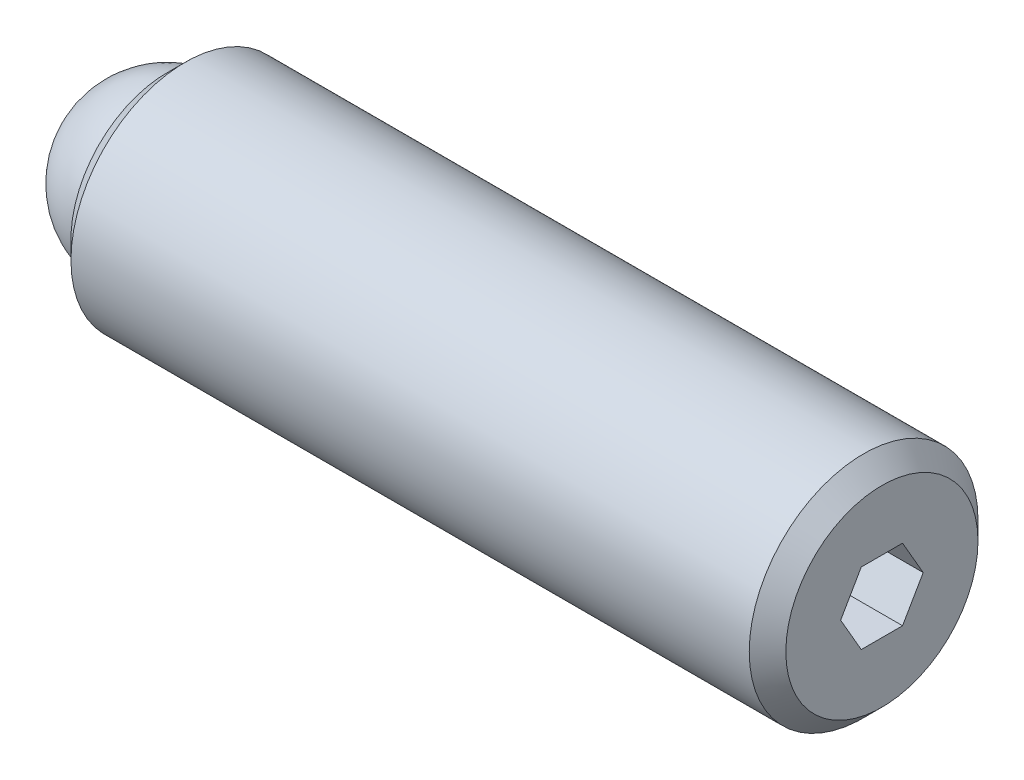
ISO-10303-21;
HEADER;
FILE_DESCRIPTION(('STEP AP214'),'2;1');
FILE_NAME('part.step','',(''),(''),'','','');
FILE_SCHEMA(('AUTOMOTIVE_DESIGN { 1 0 10303 214 1 1 1 1 }'));
ENDSEC;
DATA;
#1=APPLICATION_CONTEXT('core data for automotive mechanical design processes');
#2=APPLICATION_PROTOCOL_DEFINITION('international standard','automotive_design',2000,#1);
#3=PRODUCT_CONTEXT('',#1,'mechanical');
#4=PRODUCT('Part','Part','',(#3));
#5=PRODUCT_RELATED_PRODUCT_CATEGORY('part','',(#4));
#6=PRODUCT_DEFINITION_FORMATION('','',#4);
#7=PRODUCT_DEFINITION_CONTEXT('part definition',#1,'design');
#8=PRODUCT_DEFINITION('design','',#6,#7);
#9=PRODUCT_DEFINITION_SHAPE('','',#8);
#10=(LENGTH_UNIT() NAMED_UNIT(*) SI_UNIT(.MILLI.,.METRE.));
#11=(NAMED_UNIT(*) PLANE_ANGLE_UNIT() SI_UNIT($,.RADIAN.));
#12=(NAMED_UNIT(*) SI_UNIT($,.STERADIAN.) SOLID_ANGLE_UNIT());
#13=UNCERTAINTY_MEASURE_WITH_UNIT(LENGTH_MEASURE(1.E-05),#10,'distance_accuracy_value','');
#14=(GEOMETRIC_REPRESENTATION_CONTEXT(3) GLOBAL_UNCERTAINTY_ASSIGNED_CONTEXT((#13)) GLOBAL_UNIT_ASSIGNED_CONTEXT((#10,
#11,#12)) REPRESENTATION_CONTEXT('',''));
#15=CARTESIAN_POINT('',(0.,0.,0.));
#16=DIRECTION('',(0.,0.,1.));
#17=DIRECTION('',(1.,0.,0.));
#18=AXIS2_PLACEMENT_3D('',#15,#16,#17);
#19=CARTESIAN_POINT('',(0.,0.,0.));
#20=DIRECTION('',(0.,-1.,0.));
#21=DIRECTION('',(0.,0.,1.));
#22=AXIS2_PLACEMENT_3D('',#19,#20,#21);
#23=SPHERICAL_SURFACE('',#22,2.38125);
#24=CARTESIAN_POINT('',(0.,-2.38125,0.));
#25=VERTEX_POINT('',#24);
#26=VERTEX_LOOP('',#25);
#27=FACE_BOUND('',#26,.T.);
#28=ADVANCED_FACE('F41',(#27),#23,.T.);
#29=CLOSED_SHELL('',(#28));
#30=MANIFOLD_SOLID_BREP('B2',#29);
#31=CARTESIAN_POINT('',(19.84375,0.,0.));
#32=DIRECTION('',(-1.,0.,0.));
#33=DIRECTION('',(0.,0.,1.));
#34=AXIS2_PLACEMENT_3D('',#31,#32,#33);
#35=CYLINDRICAL_SURFACE('',#34,3.175);
#36=CARTESIAN_POINT('',(19.33575,0.,0.));
#37=DIRECTION('',(1.,0.,0.));
#38=DIRECTION('',(0.,0.,-1.));
#39=AXIS2_PLACEMENT_3D('',#36,#37,#38);
#40=CIRCLE('',#39,3.175);
#41=CARTESIAN_POINT('',(19.33575,0.,3.175));
#42=VERTEX_POINT('',#41);
#43=EDGE_CURVE('E39',#42,#42,#40,.F.);
#44=CARTESIAN_POINT('',(0.508000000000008,0.,0.));
#45=DIRECTION('',(1.,0.,0.));
#46=DIRECTION('',(0.,0.,-1.));
#47=AXIS2_PLACEMENT_3D('',#44,#45,#46);
#48=CIRCLE('',#47,3.175);
#49=CARTESIAN_POINT('',(0.508000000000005,0.,3.175));
#50=VERTEX_POINT('',#49);
#51=EDGE_CURVE('E157',#50,#50,#48,.T.);
#52=CARTESIAN_POINT('',(19.33575,0.,3.175));
#53=CARTESIAN_POINT('',(19.1396276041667,0.,3.175));
#54=CARTESIAN_POINT('',(18.9435052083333,0.,3.175));
#55=CARTESIAN_POINT('',(18.5512604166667,0.,3.175));
#56=CARTESIAN_POINT('',(18.3551380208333,0.,3.175));
#57=CARTESIAN_POINT('',(17.9628932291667,0.,3.175));
#58=CARTESIAN_POINT('',(17.7667708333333,0.,3.175));
#59=CARTESIAN_POINT('',(17.3745260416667,0.,3.175));
#60=CARTESIAN_POINT('',(17.1784036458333,0.,3.175));
#61=CARTESIAN_POINT('',(16.7861588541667,0.,3.175));
#62=CARTESIAN_POINT('',(16.5900364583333,0.,3.175));
#63=CARTESIAN_POINT('',(16.1977916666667,0.,3.175));
#64=CARTESIAN_POINT('',(16.0016692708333,0.,3.175));
#65=CARTESIAN_POINT('',(15.6094244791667,0.,3.175));
#66=CARTESIAN_POINT('',(15.4133020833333,0.,3.175));
#67=CARTESIAN_POINT('',(15.0210572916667,0.,3.175));
#68=CARTESIAN_POINT('',(14.8249348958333,0.,3.175));
#69=CARTESIAN_POINT('',(14.4326901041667,0.,3.175));
#70=CARTESIAN_POINT('',(14.2365677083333,0.,3.175));
#71=CARTESIAN_POINT('',(13.8443229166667,0.,3.175));
#72=CARTESIAN_POINT('',(13.6482005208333,0.,3.175));
#73=CARTESIAN_POINT('',(13.2559557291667,0.,3.175));
#74=CARTESIAN_POINT('',(13.0598333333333,0.,3.175));
#75=CARTESIAN_POINT('',(12.6675885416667,0.,3.175));
#76=CARTESIAN_POINT('',(12.4714661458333,0.,3.175));
#77=CARTESIAN_POINT('',(12.0792213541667,0.,3.175));
#78=CARTESIAN_POINT('',(11.8830989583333,0.,3.175));
#79=CARTESIAN_POINT('',(11.4908541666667,0.,3.175));
#80=CARTESIAN_POINT('',(11.2947317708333,0.,3.175));
#81=CARTESIAN_POINT('',(10.9024869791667,0.,3.175));
#82=CARTESIAN_POINT('',(10.7063645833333,0.,3.175));
#83=CARTESIAN_POINT('',(10.3141197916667,0.,3.175));
#84=CARTESIAN_POINT('',(10.1179973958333,0.,3.175));
#85=CARTESIAN_POINT('',(9.72575260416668,0.,3.175));
#86=CARTESIAN_POINT('',(9.52963020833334,0.,3.175));
#87=CARTESIAN_POINT('',(9.13738541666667,0.,3.175));
#88=CARTESIAN_POINT('',(8.94126302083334,0.,3.175));
#89=CARTESIAN_POINT('',(8.54901822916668,0.,3.175));
#90=CARTESIAN_POINT('',(8.35289583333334,0.,3.175));
#91=CARTESIAN_POINT('',(7.96065104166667,0.,3.175));
#92=CARTESIAN_POINT('',(7.76452864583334,0.,3.175));
#93=CARTESIAN_POINT('',(7.37228385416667,0.,3.175));
#94=CARTESIAN_POINT('',(7.17616145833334,0.,3.175));
#95=CARTESIAN_POINT('',(6.78391666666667,0.,3.175));
#96=CARTESIAN_POINT('',(6.58779427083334,0.,3.175));
#97=CARTESIAN_POINT('',(6.19554947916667,0.,3.175));
#98=CARTESIAN_POINT('',(5.99942708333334,0.,3.175));
#99=CARTESIAN_POINT('',(5.60718229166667,0.,3.175));
#100=CARTESIAN_POINT('',(5.41105989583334,0.,3.175));
#101=CARTESIAN_POINT('',(5.01881510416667,0.,3.175));
#102=CARTESIAN_POINT('',(4.82269270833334,0.,3.175));
#103=CARTESIAN_POINT('',(4.43044791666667,0.,3.175));
#104=CARTESIAN_POINT('',(4.23432552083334,0.,3.175));
#105=CARTESIAN_POINT('',(3.84208072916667,0.,3.175));
#106=CARTESIAN_POINT('',(3.64595833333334,0.,3.175));
#107=CARTESIAN_POINT('',(3.25371354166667,0.,3.175));
#108=CARTESIAN_POINT('',(3.05759114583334,0.,3.175));
#109=CARTESIAN_POINT('',(2.66534635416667,0.,3.175));
#110=CARTESIAN_POINT('',(2.46922395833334,0.,3.175));
#111=CARTESIAN_POINT('',(2.07697916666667,0.,3.175));
#112=CARTESIAN_POINT('',(1.88085677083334,0.,3.175));
#113=CARTESIAN_POINT('',(1.48861197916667,0.,3.175));
#114=CARTESIAN_POINT('',(1.29248958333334,0.,3.175));
#115=CARTESIAN_POINT('',(0.900244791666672,0.,3.175));
#116=CARTESIAN_POINT('',(0.704122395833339,0.,3.175));
#117=CARTESIAN_POINT('',(0.508000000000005,0.,3.175));
#118=B_SPLINE_CURVE_WITH_KNOTS('',3,(#52,#53,#54,#55,#56,#57,#58,#59,#60,#61,#62,#63,#64,#65,
#66,#67,#68,#69,#70,#71,#72,#73,#74,#75,#76,#77,#78,#79,#80,#81,#82,#83,#84,#85,#86,#87,#88,#89,
#90,#91,#92,#93,#94,#95,#96,#97,#98,#99,#100,#101,#102,#103,#104,#105,#106,#107,#108,#109,#110,
#111,#112,#113,#114,#115,#116,#117),.UNSPECIFIED.,.F.,.F.,(4,2,2,2,2,2,2,2,2,2,2,2,2,2,2,2,2,2,
2,2,2,2,2,2,2,2,2,2,2,2,2,2,4),(0.,0.588367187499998,1.176734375,1.7651015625,2.35346875,
2.9418359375,3.530203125,4.1185703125,4.7069375,5.2953046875,5.883671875,6.4720390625,
7.06040625,7.6487734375,8.237140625,8.8255078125,9.413875,10.0022421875,10.590609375,
11.1789765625,11.76734375,12.3557109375,12.944078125,13.5324453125,14.1208125,14.7091796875,
15.297546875,15.8859140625,16.47428125,17.0626484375,17.651015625,18.2393828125,18.82775),.UNSPECIFIED.);
#119=EDGE_CURVE('BSEAM54',#42,#50,#118,.T.);
#120=ORIENTED_EDGE('',*,*,#43,.T.);
#121=ORIENTED_EDGE('',*,*,#51,.T.);
#122=ORIENTED_EDGE('',*,*,#119,.T.);
#123=ORIENTED_EDGE('',*,*,#119,.F.);
#124=EDGE_LOOP('',(#120,#122,#121,#123));
#125=FACE_BOUND('',#124,.T.);
#126=ADVANCED_FACE('F54',(#125),#35,.T.);
#127=CARTESIAN_POINT('',(19.84375,0.,0.));
#128=DIRECTION('',(1.,0.,0.));
#129=DIRECTION('',(0.,0.,-1.));
#130=AXIS2_PLACEMENT_3D('',#127,#128,#129);
#131=PLANE('',#130);
#132=DIRECTION('',(0.,0.866025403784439,-0.5));
#133=VECTOR('',#132,1.);
#134=CARTESIAN_POINT('',(19.84375,-0.9921875,-0.572839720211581));
#135=LINE('',#134,#133);
#136=CARTESIAN_POINT('',(19.84375,-0.9921875,-0.572839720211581));
#137=VERTEX_POINT('',#136);
#138=CARTESIAN_POINT('',(19.84375,0.,-1.14567944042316));
#139=VERTEX_POINT('',#138);
#140=EDGE_CURVE('E69',#137,#139,#135,.T.);
#141=ORIENTED_EDGE('',*,*,#140,.F.);
#142=DIRECTION('',(0.,0.,-1.));
#143=VECTOR('',#142,1.);
#144=CARTESIAN_POINT('',(19.84375,-0.9921875,0.572839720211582));
#145=LINE('',#144,#143);
#146=CARTESIAN_POINT('',(19.84375,-0.9921875,0.572839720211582));
#147=VERTEX_POINT('',#146);
#148=EDGE_CURVE('E153',#147,#137,#145,.T.);
#149=ORIENTED_EDGE('',*,*,#148,.F.);
#150=DIRECTION('',(0.,-0.866025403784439,-0.5));
#151=VECTOR('',#150,1.);
#152=CARTESIAN_POINT('',(19.84375,0.,1.14567944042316));
#153=LINE('',#152,#151);
#154=CARTESIAN_POINT('',(19.84375,0.,1.14567944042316));
#155=VERTEX_POINT('',#154);
#156=EDGE_CURVE('E151',#155,#147,#153,.T.);
#157=ORIENTED_EDGE('',*,*,#156,.F.);
#158=DIRECTION('',(0.,-0.866025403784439,0.5));
#159=VECTOR('',#158,1.);
#160=CARTESIAN_POINT('',(19.84375,0.992187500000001,0.572839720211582));
#161=LINE('',#160,#159);
#162=CARTESIAN_POINT('',(19.84375,0.992187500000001,0.572839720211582));
#163=VERTEX_POINT('',#162);
#164=EDGE_CURVE('E117',#163,#155,#161,.T.);
#165=ORIENTED_EDGE('',*,*,#164,.F.);
#166=DIRECTION('',(0.,0.,1.));
#167=VECTOR('',#166,1.);
#168=CARTESIAN_POINT('',(19.84375,0.9921875,-0.572839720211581));
#169=LINE('',#168,#167);
#170=CARTESIAN_POINT('',(19.84375,0.9921875,-0.572839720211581));
#171=VERTEX_POINT('',#170);
#172=EDGE_CURVE('E147',#171,#163,#169,.T.);
#173=ORIENTED_EDGE('',*,*,#172,.F.);
#174=DIRECTION('',(0.,0.866025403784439,0.5));
#175=VECTOR('',#174,1.);
#176=CARTESIAN_POINT('',(19.84375,0.,-1.14567944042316));
#177=LINE('',#176,#175);
#178=EDGE_CURVE('E143',#139,#171,#177,.T.);
#179=ORIENTED_EDGE('',*,*,#178,.F.);
#180=EDGE_LOOP('',(#141,#149,#157,#165,#173,#179));
#181=FACE_BOUND('',#180,.T.);
#182=CARTESIAN_POINT('',(19.84375,0.,0.));
#183=DIRECTION('',(1.,0.,0.));
#184=DIRECTION('',(0.,0.,-1.));
#185=AXIS2_PLACEMENT_3D('',#182,#183,#184);
#186=CIRCLE('',#185,2.66700000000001);
#187=CARTESIAN_POINT('',(19.84375,0.,-2.66700000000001));
#188=VERTEX_POINT('',#187);
#189=EDGE_CURVE('E62',#188,#188,#186,.T.);
#190=ORIENTED_EDGE('',*,*,#189,.T.);
#191=EDGE_LOOP('',(#190));
#192=FACE_BOUND('',#191,.T.);
#193=ADVANCED_FACE('F170',(#181,#192),#131,.T.);
#194=CARTESIAN_POINT('',(0.,0.,0.));
#195=DIRECTION('',(1.,0.,0.));
#196=DIRECTION('',(0.,0.,-1.));
#197=AXIS2_PLACEMENT_3D('',#194,#195,#196);
#198=PLANE('',#197);
#199=CARTESIAN_POINT('',(0.,0.,0.));
#200=DIRECTION('',(-1.,0.,0.));
#201=DIRECTION('',(0.,0.,1.));
#202=AXIS2_PLACEMENT_3D('',#199,#200,#201);
#203=CIRCLE('',#202,2.38125);
#204=CARTESIAN_POINT('',(0.,0.,2.38125));
#205=VERTEX_POINT('',#204);
#206=EDGE_CURVE('E225',#205,#205,#203,.T.);
#207=ORIENTED_EDGE('',*,*,#206,.F.);
#208=EDGE_LOOP('',(#207));
#209=FACE_BOUND('',#208,.T.);
#210=CARTESIAN_POINT('',(0.,0.,0.));
#211=DIRECTION('',(1.,0.,0.));
#212=DIRECTION('',(0.,0.,-1.));
#213=AXIS2_PLACEMENT_3D('',#210,#211,#212);
#214=CIRCLE('',#213,2.66699999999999);
#215=CARTESIAN_POINT('',(0.,0.,-2.66699999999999));
#216=VERTEX_POINT('',#215);
#217=EDGE_CURVE('E165',#216,#216,#214,.F.);
#218=ORIENTED_EDGE('',*,*,#217,.T.);
#219=EDGE_LOOP('',(#218));
#220=FACE_BOUND('',#219,.T.);
#221=ADVANCED_FACE('F182',(#209,#220),#198,.F.);
#222=CARTESIAN_POINT('',(0.508000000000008,0.,0.));
#223=DIRECTION('',(1.,0.,0.));
#224=DIRECTION('',(0.,0.,-1.));
#225=AXIS2_PLACEMENT_3D('',#222,#223,#224);
#226=CONICAL_SURFACE('',#225,3.175,0.785398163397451);
#227=ORIENTED_EDGE('',*,*,#217,.F.);
#228=EDGE_LOOP('',(#227));
#229=FACE_BOUND('',#228,.T.);
#230=ORIENTED_EDGE('',*,*,#51,.F.);
#231=EDGE_LOOP('',(#230));
#232=FACE_BOUND('',#231,.T.);
#233=ADVANCED_FACE('F174',(#229,#232),#226,.T.);
#234=CARTESIAN_POINT('',(19.84375,0.,0.));
#235=DIRECTION('',(-1.,0.,0.));
#236=DIRECTION('',(0.,0.,1.));
#237=AXIS2_PLACEMENT_3D('',#234,#235,#236);
#238=CONICAL_SURFACE('',#237,2.66700000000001,0.785398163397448);
#239=ORIENTED_EDGE('',*,*,#43,.F.);
#240=EDGE_LOOP('',(#239));
#241=FACE_BOUND('',#240,.T.);
#242=ORIENTED_EDGE('',*,*,#189,.F.);
#243=EDGE_LOOP('',(#242));
#244=FACE_BOUND('',#243,.T.);
#245=ADVANCED_FACE('F56',(#241,#244),#238,.T.);
#246=CARTESIAN_POINT('',(17.55775,-0.9921875,-0.572839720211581));
#247=DIRECTION('',(0.,-0.5,-0.866025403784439));
#248=DIRECTION('',(0.,0.866025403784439,-0.5));
#249=AXIS2_PLACEMENT_3D('',#246,#247,#248);
#250=PLANE('',#249);
#251=ORIENTED_EDGE('',*,*,#140,.T.);
#252=DIRECTION('',(1.,0.,0.));
#253=VECTOR('',#252,1.);
#254=CARTESIAN_POINT('',(17.55775,0.,-1.14567944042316));
#255=LINE('',#254,#253);
#256=CARTESIAN_POINT('',(17.55775,0.,-1.14567944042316));
#257=VERTEX_POINT('',#256);
#258=EDGE_CURVE('E99',#257,#139,#255,.T.);
#259=ORIENTED_EDGE('',*,*,#258,.F.);
#260=DIRECTION('',(0.,0.866025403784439,-0.5));
#261=VECTOR('',#260,1.);
#262=CARTESIAN_POINT('',(17.55775,-0.9921875,-0.572839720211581));
#263=LINE('',#262,#261);
#264=CARTESIAN_POINT('',(17.55775,-0.9921875,-0.572839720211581));
#265=VERTEX_POINT('',#264);
#266=EDGE_CURVE('E155',#265,#257,#263,.T.);
#267=ORIENTED_EDGE('',*,*,#266,.F.);
#268=DIRECTION('',(1.,0.,0.));
#269=VECTOR('',#268,1.);
#270=CARTESIAN_POINT('',(17.55775,-0.9921875,-0.572839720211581));
#271=LINE('',#270,#269);
#272=EDGE_CURVE('E77',#265,#137,#271,.T.);
#273=ORIENTED_EDGE('',*,*,#272,.T.);
#274=EDGE_LOOP('',(#251,#259,#267,#273));
#275=FACE_BOUND('',#274,.T.);
#276=ADVANCED_FACE('F173',(#275),#250,.F.);
#277=CARTESIAN_POINT('',(17.55775,-0.9921875,0.572839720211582));
#278=DIRECTION('',(0.,-1.,0.));
#279=DIRECTION('',(0.,0.,-1.));
#280=AXIS2_PLACEMENT_3D('',#277,#278,#279);
#281=PLANE('',#280);
#282=ORIENTED_EDGE('',*,*,#148,.T.);
#283=ORIENTED_EDGE('',*,*,#272,.F.);
#284=DIRECTION('',(0.,0.,-1.));
#285=VECTOR('',#284,1.);
#286=CARTESIAN_POINT('',(17.55775,-0.9921875,0.572839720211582));
#287=LINE('',#286,#285);
#288=CARTESIAN_POINT('',(17.55775,-0.9921875,0.572839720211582));
#289=VERTEX_POINT('',#288);
#290=EDGE_CURVE('E129',#289,#265,#287,.T.);
#291=ORIENTED_EDGE('',*,*,#290,.F.);
#292=DIRECTION('',(1.,0.,0.));
#293=VECTOR('',#292,1.);
#294=CARTESIAN_POINT('',(17.55775,-0.9921875,0.572839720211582));
#295=LINE('',#294,#293);
#296=EDGE_CURVE('E121',#289,#147,#295,.T.);
#297=ORIENTED_EDGE('',*,*,#296,.T.);
#298=EDGE_LOOP('',(#282,#283,#291,#297));
#299=FACE_BOUND('',#298,.T.);
#300=ADVANCED_FACE('F180',(#299),#281,.F.);
#301=CARTESIAN_POINT('',(17.55775,0.,1.14567944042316));
#302=DIRECTION('',(0.,-0.5,0.866025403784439));
#303=DIRECTION('',(0.,-0.866025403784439,-0.5));
#304=AXIS2_PLACEMENT_3D('',#301,#302,#303);
#305=PLANE('',#304);
#306=ORIENTED_EDGE('',*,*,#156,.T.);
#307=ORIENTED_EDGE('',*,*,#296,.F.);
#308=DIRECTION('',(0.,-0.866025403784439,-0.5));
#309=VECTOR('',#308,1.);
#310=CARTESIAN_POINT('',(17.55775,0.,1.14567944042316));
#311=LINE('',#310,#309);
#312=CARTESIAN_POINT('',(17.55775,0.,1.14567944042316));
#313=VERTEX_POINT('',#312);
#314=EDGE_CURVE('E125',#313,#289,#311,.T.);
#315=ORIENTED_EDGE('',*,*,#314,.F.);
#316=DIRECTION('',(1.,0.,0.));
#317=VECTOR('',#316,1.);
#318=CARTESIAN_POINT('',(17.55775,0.,1.14567944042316));
#319=LINE('',#318,#317);
#320=EDGE_CURVE('E110',#313,#155,#319,.T.);
#321=ORIENTED_EDGE('',*,*,#320,.T.);
#322=EDGE_LOOP('',(#306,#307,#315,#321));
#323=FACE_BOUND('',#322,.T.);
#324=ADVANCED_FACE('F126',(#323),#305,.F.);
#325=CARTESIAN_POINT('',(17.55775,0.992187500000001,0.572839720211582));
#326=DIRECTION('',(0.,0.5,0.866025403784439));
#327=DIRECTION('',(0.,-0.866025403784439,0.5));
#328=AXIS2_PLACEMENT_3D('',#325,#326,#327);
#329=PLANE('',#328);
#330=ORIENTED_EDGE('',*,*,#164,.T.);
#331=ORIENTED_EDGE('',*,*,#320,.F.);
#332=DIRECTION('',(0.,-0.866025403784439,0.5));
#333=VECTOR('',#332,1.);
#334=CARTESIAN_POINT('',(17.55775,0.992187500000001,0.572839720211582));
#335=LINE('',#334,#333);
#336=CARTESIAN_POINT('',(17.55775,0.992187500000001,0.572839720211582));
#337=VERTEX_POINT('',#336);
#338=EDGE_CURVE('E114',#337,#313,#335,.T.);
#339=ORIENTED_EDGE('',*,*,#338,.F.);
#340=DIRECTION('',(1.,0.,0.));
#341=VECTOR('',#340,1.);
#342=CARTESIAN_POINT('',(17.55775,0.992187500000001,0.572839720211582));
#343=LINE('',#342,#341);
#344=EDGE_CURVE('E122',#337,#163,#343,.T.);
#345=ORIENTED_EDGE('',*,*,#344,.T.);
#346=EDGE_LOOP('',(#330,#331,#339,#345));
#347=FACE_BOUND('',#346,.T.);
#348=ADVANCED_FACE('F112',(#347),#329,.F.);
#349=CARTESIAN_POINT('',(17.55775,0.9921875,-0.572839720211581));
#350=DIRECTION('',(0.,1.,0.));
#351=DIRECTION('',(0.,0.,1.));
#352=AXIS2_PLACEMENT_3D('',#349,#350,#351);
#353=PLANE('',#352);
#354=ORIENTED_EDGE('',*,*,#172,.T.);
#355=ORIENTED_EDGE('',*,*,#344,.F.);
#356=DIRECTION('',(0.,0.,1.));
#357=VECTOR('',#356,1.);
#358=CARTESIAN_POINT('',(17.55775,0.9921875,-0.572839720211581));
#359=LINE('',#358,#357);
#360=CARTESIAN_POINT('',(17.55775,0.9921875,-0.572839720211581));
#361=VERTEX_POINT('',#360);
#362=EDGE_CURVE('E135',#361,#337,#359,.T.);
#363=ORIENTED_EDGE('',*,*,#362,.F.);
#364=DIRECTION('',(1.,0.,0.));
#365=VECTOR('',#364,1.);
#366=CARTESIAN_POINT('',(17.55775,0.9921875,-0.572839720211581));
#367=LINE('',#366,#365);
#368=EDGE_CURVE('E160',#361,#171,#367,.T.);
#369=ORIENTED_EDGE('',*,*,#368,.T.);
#370=EDGE_LOOP('',(#354,#355,#363,#369));
#371=FACE_BOUND('',#370,.T.);
#372=ADVANCED_FACE('F201',(#371),#353,.F.);
#373=CARTESIAN_POINT('',(17.55775,0.,-1.14567944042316));
#374=DIRECTION('',(0.,0.5,-0.866025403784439));
#375=DIRECTION('',(0.,0.866025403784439,0.5));
#376=AXIS2_PLACEMENT_3D('',#373,#374,#375);
#377=PLANE('',#376);
#378=ORIENTED_EDGE('',*,*,#178,.T.);
#379=ORIENTED_EDGE('',*,*,#368,.F.);
#380=DIRECTION('',(0.,0.866025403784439,0.5));
#381=VECTOR('',#380,1.);
#382=CARTESIAN_POINT('',(17.55775,0.,-1.14567944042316));
#383=LINE('',#382,#381);
#384=EDGE_CURVE('E137',#257,#361,#383,.T.);
#385=ORIENTED_EDGE('',*,*,#384,.F.);
#386=ORIENTED_EDGE('',*,*,#258,.T.);
#387=EDGE_LOOP('',(#378,#379,#385,#386));
#388=FACE_BOUND('',#387,.T.);
#389=ADVANCED_FACE('F198',(#388),#377,.F.);
#390=CARTESIAN_POINT('',(17.55775,0.,0.));
#391=DIRECTION('',(1.,0.,0.));
#392=DIRECTION('',(0.,0.,-1.));
#393=AXIS2_PLACEMENT_3D('',#390,#391,#392);
#394=PLANE('',#393);
#395=ORIENTED_EDGE('',*,*,#266,.T.);
#396=ORIENTED_EDGE('',*,*,#384,.T.);
#397=ORIENTED_EDGE('',*,*,#362,.T.);
#398=ORIENTED_EDGE('',*,*,#338,.T.);
#399=ORIENTED_EDGE('',*,*,#314,.T.);
#400=ORIENTED_EDGE('',*,*,#290,.T.);
#401=EDGE_LOOP('',(#395,#396,#397,#398,#399,#400));
#402=FACE_BOUND('',#401,.T.);
#403=ADVANCED_FACE('F132',(#402),#394,.T.);
#404=CARTESIAN_POINT('',(1.984375,0.,0.));
#405=DIRECTION('',(-1.,0.,0.));
#406=DIRECTION('',(0.,0.,1.));
#407=AXIS2_PLACEMENT_3D('',#404,#405,#406);
#408=CYLINDRICAL_SURFACE('',#407,2.38125);
#409=CARTESIAN_POINT('',(1.984375,0.,0.));
#410=DIRECTION('',(-1.,0.,0.));
#411=DIRECTION('',(0.,0.,1.));
#412=AXIS2_PLACEMENT_3D('',#409,#410,#411);
#413=CIRCLE('',#412,2.38125);
#414=CARTESIAN_POINT('',(1.984375,0.,2.38125));
#415=VERTEX_POINT('',#414);
#416=EDGE_CURVE('E144',#415,#415,#413,.T.);
#417=ORIENTED_EDGE('',*,*,#416,.F.);
#418=EDGE_LOOP('',(#417));
#419=FACE_BOUND('',#418,.T.);
#420=ORIENTED_EDGE('',*,*,#206,.T.);
#421=EDGE_LOOP('',(#420));
#422=FACE_BOUND('',#421,.T.);
#423=ADVANCED_FACE('F214',(#419,#422),#408,.F.);
#424=CARTESIAN_POINT('',(1.984375,0.,0.));
#425=DIRECTION('',(-1.,0.,0.));
#426=DIRECTION('',(0.,0.,1.));
#427=AXIS2_PLACEMENT_3D('',#424,#425,#426);
#428=PLANE('',#427);
#429=ORIENTED_EDGE('',*,*,#416,.T.);
#430=EDGE_LOOP('',(#429));
#431=FACE_BOUND('',#430,.T.);
#432=ADVANCED_FACE('F217',(#431),#428,.T.);
#433=CLOSED_SHELL('',(#126,#193,#221,#233,#245,#276,#300,#324,#348,#372,#389,#403,#423,#432));
#434=MANIFOLD_SOLID_BREP('B6',#433);
#435=ADVANCED_BREP_SHAPE_REPRESENTATION('',(#18,#30,#434),#14);
#436=SHAPE_DEFINITION_REPRESENTATION(#9,#435);
ENDSEC;
END-ISO-10303-21;
